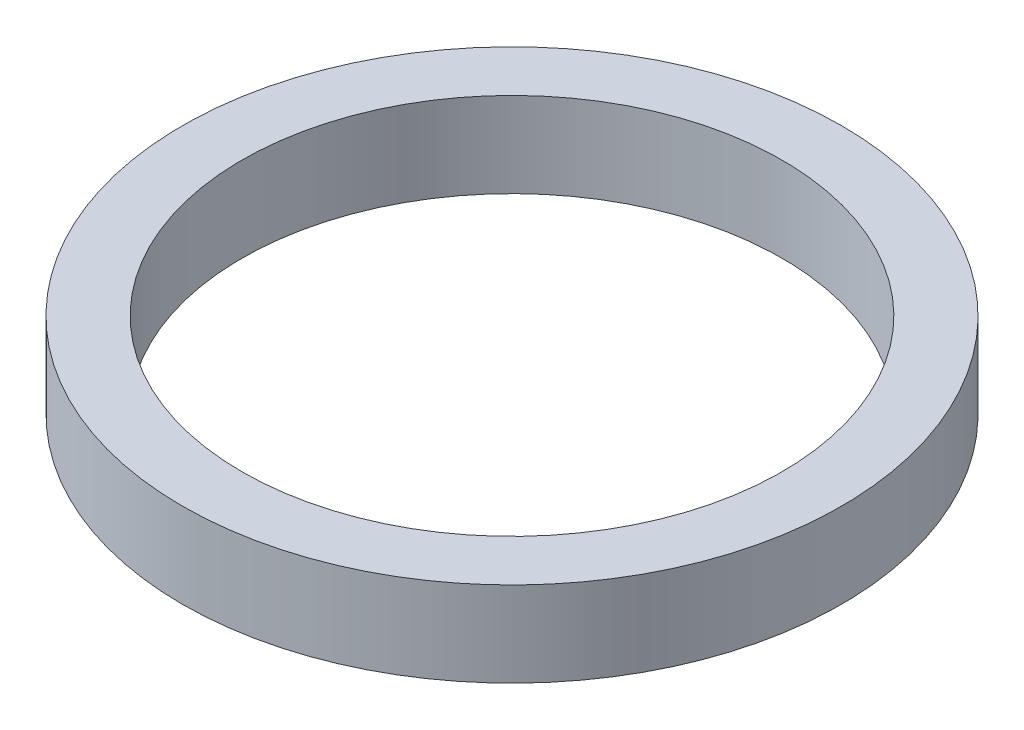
ISO-10303-21;
HEADER;
FILE_DESCRIPTION(('STEP AP214'),'2;1');
FILE_NAME('part.step','',(''),(''),'','','');
FILE_SCHEMA(('AUTOMOTIVE_DESIGN { 1 0 10303 214 1 1 1 1 }'));
ENDSEC;
DATA;
#1=APPLICATION_CONTEXT('core data for automotive mechanical design processes');
#2=APPLICATION_PROTOCOL_DEFINITION('international standard','automotive_design',2000,#1);
#3=PRODUCT_CONTEXT('',#1,'mechanical');
#4=PRODUCT('Part','Part','',(#3));
#5=PRODUCT_RELATED_PRODUCT_CATEGORY('part','',(#4));
#6=PRODUCT_DEFINITION_FORMATION('','',#4);
#7=PRODUCT_DEFINITION_CONTEXT('part definition',#1,'design');
#8=PRODUCT_DEFINITION('design','',#6,#7);
#9=PRODUCT_DEFINITION_SHAPE('','',#8);
#10=(LENGTH_UNIT() NAMED_UNIT(*) SI_UNIT(.MILLI.,.METRE.));
#11=(NAMED_UNIT(*) PLANE_ANGLE_UNIT() SI_UNIT($,.RADIAN.));
#12=(NAMED_UNIT(*) SI_UNIT($,.STERADIAN.) SOLID_ANGLE_UNIT());
#13=UNCERTAINTY_MEASURE_WITH_UNIT(LENGTH_MEASURE(1.E-05),#10,'distance_accuracy_value','');
#14=(GEOMETRIC_REPRESENTATION_CONTEXT(3) GLOBAL_UNCERTAINTY_ASSIGNED_CONTEXT((#13)) GLOBAL_UNIT_ASSIGNED_CONTEXT((#10,
#11,#12)) REPRESENTATION_CONTEXT('',''));
#15=CARTESIAN_POINT('',(0.,0.,0.));
#16=DIRECTION('',(0.,0.,1.));
#17=DIRECTION('',(1.,0.,0.));
#18=AXIS2_PLACEMENT_3D('',#15,#16,#17);
#19=CARTESIAN_POINT('',(0.,5.,0.));
#20=DIRECTION('',(0.,1.,0.));
#21=DIRECTION('',(0.,0.,1.));
#22=AXIS2_PLACEMENT_3D('',#19,#20,#21);
#23=PLANE('',#22);
#24=CARTESIAN_POINT('',(0.,5.,0.));
#25=DIRECTION('',(0.,1.,0.));
#26=DIRECTION('',(0.,0.,1.));
#27=AXIS2_PLACEMENT_3D('',#24,#25,#26);
#28=CIRCLE('',#27,19.375);
#29=CARTESIAN_POINT('',(0.,5.,19.375));
#30=VERTEX_POINT('',#29);
#31=EDGE_CURVE('E10',#30,#30,#28,.T.);
#32=ORIENTED_EDGE('',*,*,#31,.T.);
#33=EDGE_LOOP('',(#32));
#34=FACE_BOUND('',#33,.T.);
#35=CARTESIAN_POINT('',(0.,5.,0.));
#36=DIRECTION('',(0.,1.,0.));
#37=DIRECTION('',(0.,0.,1.));
#38=AXIS2_PLACEMENT_3D('',#35,#36,#37);
#39=CIRCLE('',#38,15.875);
#40=CARTESIAN_POINT('',(0.,5.,15.875));
#41=VERTEX_POINT('',#40);
#42=EDGE_CURVE('E42',#41,#41,#39,.T.);
#43=ORIENTED_EDGE('',*,*,#42,.F.);
#44=EDGE_LOOP('',(#43));
#45=FACE_BOUND('',#44,.T.);
#46=ADVANCED_FACE('F31',(#34,#45),#23,.T.);
#47=CARTESIAN_POINT('',(0.,0.,0.));
#48=DIRECTION('',(0.,1.,0.));
#49=DIRECTION('',(0.,0.,1.));
#50=AXIS2_PLACEMENT_3D('',#47,#48,#49);
#51=PLANE('',#50);
#52=CARTESIAN_POINT('',(0.,0.,0.));
#53=DIRECTION('',(0.,1.,0.));
#54=DIRECTION('',(0.,0.,1.));
#55=AXIS2_PLACEMENT_3D('',#52,#53,#54);
#56=CIRCLE('',#55,19.375);
#57=CARTESIAN_POINT('',(0.,0.,19.375));
#58=VERTEX_POINT('',#57);
#59=EDGE_CURVE('E35',#58,#58,#56,.T.);
#60=ORIENTED_EDGE('',*,*,#59,.F.);
#61=EDGE_LOOP('',(#60));
#62=FACE_BOUND('',#61,.T.);
#63=CARTESIAN_POINT('',(0.,0.,0.));
#64=DIRECTION('',(0.,1.,0.));
#65=DIRECTION('',(0.,0.,1.));
#66=AXIS2_PLACEMENT_3D('',#63,#64,#65);
#67=CIRCLE('',#66,15.875);
#68=CARTESIAN_POINT('',(0.,0.,15.875));
#69=VERTEX_POINT('',#68);
#70=EDGE_CURVE('E44',#69,#69,#67,.T.);
#71=ORIENTED_EDGE('',*,*,#70,.T.);
#72=EDGE_LOOP('',(#71));
#73=FACE_BOUND('',#72,.T.);
#74=ADVANCED_FACE('F54',(#62,#73),#51,.F.);
#75=CARTESIAN_POINT('',(0.,5.,0.));
#76=DIRECTION('',(0.,-1.,0.));
#77=DIRECTION('',(0.,0.,-1.));
#78=AXIS2_PLACEMENT_3D('',#75,#76,#77);
#79=CYLINDRICAL_SURFACE('',#78,19.375);
#80=ORIENTED_EDGE('',*,*,#31,.F.);
#81=EDGE_LOOP('',(#80));
#82=FACE_BOUND('',#81,.T.);
#83=ORIENTED_EDGE('',*,*,#59,.T.);
#84=EDGE_LOOP('',(#83));
#85=FACE_BOUND('',#84,.T.);
#86=ADVANCED_FACE('F33',(#82,#85),#79,.T.);
#87=CARTESIAN_POINT('',(0.,5.,0.));
#88=DIRECTION('',(0.,-1.,0.));
#89=DIRECTION('',(0.,0.,-1.));
#90=AXIS2_PLACEMENT_3D('',#87,#88,#89);
#91=CYLINDRICAL_SURFACE('',#90,15.875);
#92=ORIENTED_EDGE('',*,*,#42,.T.);
#93=EDGE_LOOP('',(#92));
#94=FACE_BOUND('',#93,.T.);
#95=ORIENTED_EDGE('',*,*,#70,.F.);
#96=EDGE_LOOP('',(#95));
#97=FACE_BOUND('',#96,.T.);
#98=ADVANCED_FACE('F50',(#94,#97),#91,.F.);
#99=CLOSED_SHELL('',(#46,#74,#86,#98));
#100=MANIFOLD_SOLID_BREP('B2',#99);
#101=ADVANCED_BREP_SHAPE_REPRESENTATION('',(#18,#100),#14);
#102=SHAPE_DEFINITION_REPRESENTATION(#9,#101);
ENDSEC;
END-ISO-10303-21;
